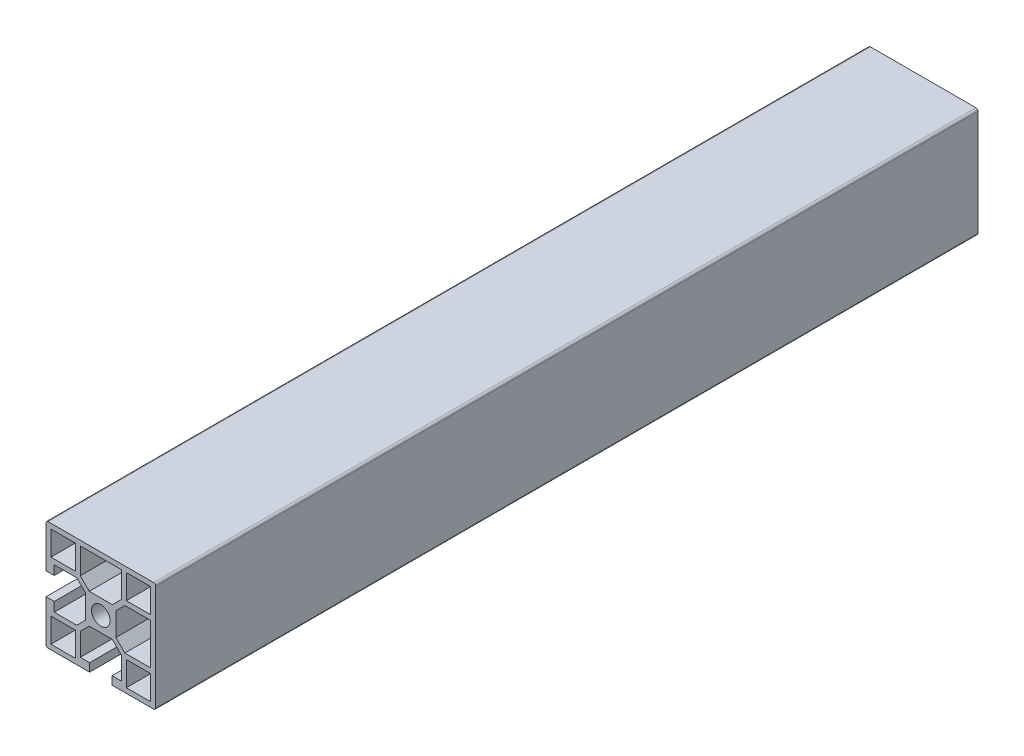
from build123d import *

# Parameters (mm, degrees)
MODEL_R         = 3.4
MODEL_W         = 8.9
MODEL_H         = 8.9
EXTRUDE_1_DEPTH = 300


with BuildPart() as part:
    # Model → Extrude 1 (new body)
    with BuildSketch(Plane.XY):
        with BuildLine():
            Line((8072.729330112, 2645.472808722), (8034.229330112, 2645.472808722))
            ThreePointArc((8034.229330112, 2645.472808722), (8033.699000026, 2645.253138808), (8033.479330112, 2644.722808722))
            Line((8033.479330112, 2644.722808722), (8033.479330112, 2629.572808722))
            Line((8033.479330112, 2629.572808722), (8036.479330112, 2629.572808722))
            Line((8036.479330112, 2629.572808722), (8036.479330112, 2632.972808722))
            Line((8036.479330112, 2632.972808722), (8044.706537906, 2632.972808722))
            Line((8044.706537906, 2632.972808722), (8047.979330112, 2629.700016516))
            Line((8047.979330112, 2629.700016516), (8047.979330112, 2621.245600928))
            Line((8047.979330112, 2621.245600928), (8044.706537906, 2617.972808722))
            Line((8044.706537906, 2617.972808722), (8036.479330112, 2617.972808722))
            Line((8036.479330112, 2617.972808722), (8036.479330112, 2621.372808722))
            Line((8036.479330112, 2621.372808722), (8033.479330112, 2621.372808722))
            Line((8033.479330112, 2621.372808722), (8033.479330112, 2606.222808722))
            ThreePointArc((8033.479330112, 2606.222808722), (8033.699000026, 2605.692478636), (8034.229330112, 2605.472808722))
            Line((8034.229330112, 2605.472808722), (8049.379330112, 2605.472808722))
            Line((8049.379330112, 2605.472808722), (8049.379330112, 2608.472808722))
            Line((8049.379330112, 2608.472808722), (8045.979330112, 2608.472808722))
            Line((8045.979330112, 2608.472808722), (8045.979330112, 2616.700016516))
            Line((8045.979330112, 2616.700016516), (8049.252122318, 2619.972808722))
            Line((8049.252122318, 2619.972808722), (8057.706537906, 2619.972808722))
            Line((8057.706537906, 2619.972808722), (8060.979330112, 2616.700016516))
            Line((8060.979330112, 2616.700016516), (8060.979330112, 2608.472808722))
            Line((8060.979330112, 2608.472808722), (8057.579330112, 2608.472808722))
            Line((8057.579330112, 2608.472808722), (8057.579330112, 2605.472808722))
            Line((8057.579330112, 2605.472808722), (8072.729330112, 2605.472808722))
            ThreePointArc((8072.729330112, 2605.472808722), (8073.259660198, 2605.692478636), (8073.479330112, 2606.222808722))
            Line((8073.479330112, 2606.222808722), (8073.479330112, 2644.722808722))
            ThreePointArc((8073.479330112, 2644.722808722), (8073.259660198, 2645.253138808), (8072.729330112, 2645.472808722))
        make_face()
        with Locations((8053.479330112, 2625.472808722)):
            Circle(MODEL_R, mode=Mode.SUBTRACT)
        with Locations((8039.729330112, 2611.722808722)):
            Rectangle(MODEL_W, MODEL_H, mode=Mode.SUBTRACT)
        with Locations((8039.729330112, 2639.222808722)):
            Rectangle(MODEL_W, MODEL_H, mode=Mode.SUBTRACT)
        Polygon((8057.706537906, 2630.972808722), (8049.252122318, 2630.972808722), (8045.979330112, 2634.245600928), (8045.979330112, 2643.672808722), (8060.979330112, 2643.672808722), (8060.979330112, 2634.245600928), align=None, mode=Mode.SUBTRACT)
        with Locations((8067.229330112, 2611.722808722)):
            Rectangle(MODEL_W, MODEL_H, mode=Mode.SUBTRACT)
        Polygon((8062.252122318, 2632.972808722), (8071.679330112, 2632.972808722), (8071.679330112, 2617.972808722), (8062.252122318, 2617.972808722), (8058.979330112, 2621.245600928), (8058.979330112, 2629.700016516), align=None, mode=Mode.SUBTRACT)
        with Locations((8067.229330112, 2639.222808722)):
            Rectangle(MODEL_W, MODEL_H, mode=Mode.SUBTRACT)
    extrude(amount=EXTRUDE_1_DEPTH)


solid = part.part
